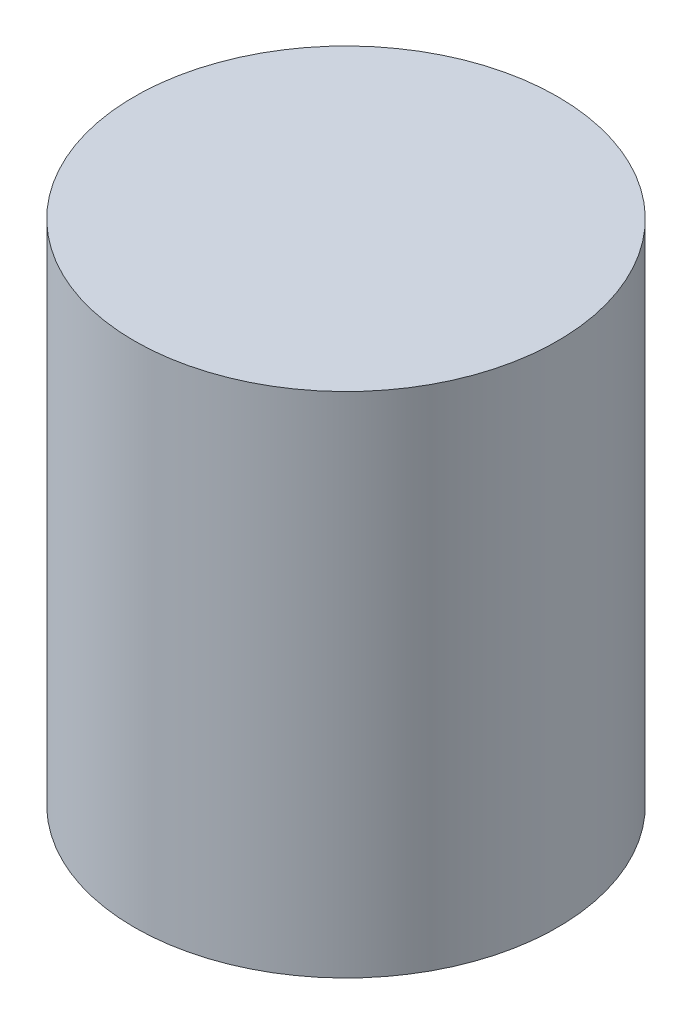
ISO-10303-21;
HEADER;
FILE_DESCRIPTION(('STEP AP214'),'2;1');
FILE_NAME('part.step','',(''),(''),'','','');
FILE_SCHEMA(('AUTOMOTIVE_DESIGN { 1 0 10303 214 1 1 1 1 }'));
ENDSEC;
DATA;
#1=APPLICATION_CONTEXT('core data for automotive mechanical design processes');
#2=APPLICATION_PROTOCOL_DEFINITION('international standard','automotive_design',2000,#1);
#3=PRODUCT_CONTEXT('',#1,'mechanical');
#4=PRODUCT('Part','Part','',(#3));
#5=PRODUCT_RELATED_PRODUCT_CATEGORY('part','',(#4));
#6=PRODUCT_DEFINITION_FORMATION('','',#4);
#7=PRODUCT_DEFINITION_CONTEXT('part definition',#1,'design');
#8=PRODUCT_DEFINITION('design','',#6,#7);
#9=PRODUCT_DEFINITION_SHAPE('','',#8);
#10=(LENGTH_UNIT() NAMED_UNIT(*) SI_UNIT(.MILLI.,.METRE.));
#11=(NAMED_UNIT(*) PLANE_ANGLE_UNIT() SI_UNIT($,.RADIAN.));
#12=(NAMED_UNIT(*) SI_UNIT($,.STERADIAN.) SOLID_ANGLE_UNIT());
#13=UNCERTAINTY_MEASURE_WITH_UNIT(LENGTH_MEASURE(1.E-05),#10,'distance_accuracy_value','');
#14=(GEOMETRIC_REPRESENTATION_CONTEXT(3) GLOBAL_UNCERTAINTY_ASSIGNED_CONTEXT((#13)) GLOBAL_UNIT_ASSIGNED_CONTEXT((#10,
#11,#12)) REPRESENTATION_CONTEXT('',''));
#15=CARTESIAN_POINT('',(0.,0.,0.));
#16=DIRECTION('',(0.,0.,1.));
#17=DIRECTION('',(1.,0.,0.));
#18=AXIS2_PLACEMENT_3D('',#15,#16,#17);
#19=CARTESIAN_POINT('',(0.,120.,0.));
#20=DIRECTION('',(0.,-1.,0.));
#21=DIRECTION('',(0.,0.,-1.));
#22=AXIS2_PLACEMENT_3D('',#19,#20,#21);
#23=CYLINDRICAL_SURFACE('',#22,50.);
#24=CARTESIAN_POINT('',(0.,120.,0.));
#25=DIRECTION('',(0.,1.,0.));
#26=DIRECTION('',(0.,0.,1.));
#27=AXIS2_PLACEMENT_3D('',#24,#25,#26);
#28=CIRCLE('',#27,50.);
#29=CARTESIAN_POINT('',(0.,120.,50.));
#30=VERTEX_POINT('',#29);
#31=EDGE_CURVE('E10',#30,#30,#28,.T.);
#32=ORIENTED_EDGE('',*,*,#31,.F.);
#33=EDGE_LOOP('',(#32));
#34=FACE_BOUND('',#33,.T.);
#35=CARTESIAN_POINT('',(0.,0.,0.));
#36=DIRECTION('',(0.,1.,0.));
#37=DIRECTION('',(0.,0.,1.));
#38=AXIS2_PLACEMENT_3D('',#35,#36,#37);
#39=CIRCLE('',#38,50.);
#40=CARTESIAN_POINT('',(0.,0.,50.));
#41=VERTEX_POINT('',#40);
#42=EDGE_CURVE('E31',#41,#41,#39,.T.);
#43=ORIENTED_EDGE('',*,*,#42,.T.);
#44=EDGE_LOOP('',(#43));
#45=FACE_BOUND('',#44,.T.);
#46=ADVANCED_FACE('F28',(#34,#45),#23,.T.);
#47=CARTESIAN_POINT('',(0.,120.,0.));
#48=DIRECTION('',(0.,1.,0.));
#49=DIRECTION('',(0.,0.,1.));
#50=AXIS2_PLACEMENT_3D('',#47,#48,#49);
#51=PLANE('',#50);
#52=ORIENTED_EDGE('',*,*,#31,.T.);
#53=EDGE_LOOP('',(#52));
#54=FACE_BOUND('',#53,.T.);
#55=ADVANCED_FACE('F43',(#54),#51,.T.);
#56=CARTESIAN_POINT('',(0.,0.,0.));
#57=DIRECTION('',(0.,1.,0.));
#58=DIRECTION('',(0.,0.,1.));
#59=AXIS2_PLACEMENT_3D('',#56,#57,#58);
#60=PLANE('',#59);
#61=ORIENTED_EDGE('',*,*,#42,.F.);
#62=EDGE_LOOP('',(#61));
#63=FACE_BOUND('',#62,.T.);
#64=ADVANCED_FACE('F41',(#63),#60,.F.);
#65=CLOSED_SHELL('',(#46,#55,#64));
#66=MANIFOLD_SOLID_BREP('B2',#65);
#67=ADVANCED_BREP_SHAPE_REPRESENTATION('',(#18,#66),#14);
#68=SHAPE_DEFINITION_REPRESENTATION(#9,#67);
ENDSEC;
END-ISO-10303-21;
